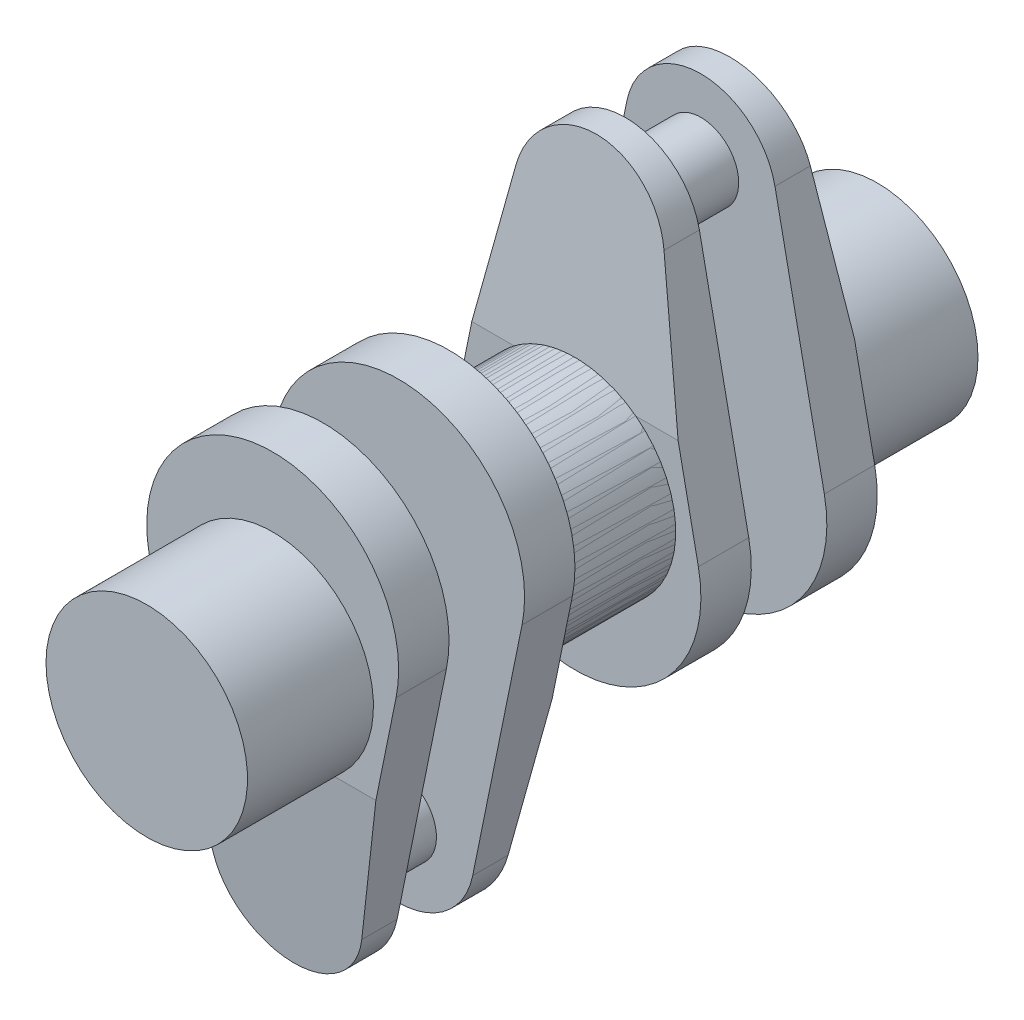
ISO-10303-21;
HEADER;
FILE_DESCRIPTION(('STEP AP214'),'2;1');
FILE_NAME('part.step','',(''),(''),'','','');
FILE_SCHEMA(('AUTOMOTIVE_DESIGN { 1 0 10303 214 1 1 1 1 }'));
ENDSEC;
DATA;
#1=APPLICATION_CONTEXT('core data for automotive mechanical design processes');
#2=APPLICATION_PROTOCOL_DEFINITION('international standard','automotive_design',2000,#1);
#3=PRODUCT_CONTEXT('',#1,'mechanical');
#4=PRODUCT('Part','Part','',(#3));
#5=PRODUCT_RELATED_PRODUCT_CATEGORY('part','',(#4));
#6=PRODUCT_DEFINITION_FORMATION('','',#4);
#7=PRODUCT_DEFINITION_CONTEXT('part definition',#1,'design');
#8=PRODUCT_DEFINITION('design','',#6,#7);
#9=PRODUCT_DEFINITION_SHAPE('','',#8);
#10=(LENGTH_UNIT() NAMED_UNIT(*) SI_UNIT(.MILLI.,.METRE.));
#11=(NAMED_UNIT(*) PLANE_ANGLE_UNIT() SI_UNIT($,.RADIAN.));
#12=(NAMED_UNIT(*) SI_UNIT($,.STERADIAN.) SOLID_ANGLE_UNIT());
#13=UNCERTAINTY_MEASURE_WITH_UNIT(LENGTH_MEASURE(1.E-05),#10,'distance_accuracy_value','');
#14=(GEOMETRIC_REPRESENTATION_CONTEXT(3) GLOBAL_UNCERTAINTY_ASSIGNED_CONTEXT((#13)) GLOBAL_UNIT_ASSIGNED_CONTEXT((#10,
#11,#12)) REPRESENTATION_CONTEXT('',''));
#15=CARTESIAN_POINT('',(0.,0.,0.));
#16=DIRECTION('',(0.,0.,1.));
#17=DIRECTION('',(1.,0.,0.));
#18=AXIS2_PLACEMENT_3D('',#15,#16,#17);
#19=CARTESIAN_POINT('',(24.8868157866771,12.7000000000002,86.3599999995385));
#20=DIRECTION('',(0.979795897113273,-0.199999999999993,0.));
#21=DIRECTION('',(0.199999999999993,0.979795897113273,0.));
#22=AXIS2_PLACEMENT_3D('',#19,#20,#21);
#23=PLANE('',#22);
#24=DIRECTION('',(0.199999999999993,0.979795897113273,0.));
#25=VECTOR('',#24,1.);
#26=CARTESIAN_POINT('',(24.8868157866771,12.7000000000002,96.5199999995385));
#27=LINE('',#26,#25);
#28=CARTESIAN_POINT('',(20.8053615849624,-7.29496040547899,96.5199999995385));
#29=VERTEX_POINT('',#28);
#30=CARTESIAN_POINT('',(24.8868157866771,12.7000000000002,96.5199999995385));
#31=VERTEX_POINT('',#30);
#32=EDGE_CURVE('E298',#29,#31,#27,.T.);
#33=ORIENTED_EDGE('',*,*,#32,.F.);
#34=DIRECTION('',(-0.198947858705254,-0.974641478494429,-0.102438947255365));
#35=VECTOR('',#34,1.);
#36=CARTESIAN_POINT('',(11.9508946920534,-50.6728120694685,91.9608040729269));
#37=LINE('',#36,#35);
#38=CARTESIAN_POINT('',(14.9320894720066,-36.0679999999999,93.4958316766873));
#39=VERTEX_POINT('',#38);
#40=EDGE_CURVE('E296',#39,#29,#37,.F.);
#41=ORIENTED_EDGE('',*,*,#40,.F.);
#42=DIRECTION('',(0.,0.,1.));
#43=VECTOR('',#42,1.);
#44=CARTESIAN_POINT('',(14.9320894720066,-36.0679999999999,86.3599999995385));
#45=LINE('',#44,#43);
#46=CARTESIAN_POINT('',(14.9320894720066,-36.0679999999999,86.3599999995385));
#47=VERTEX_POINT('',#46);
#48=EDGE_CURVE('E323',#47,#39,#45,.T.);
#49=ORIENTED_EDGE('',*,*,#48,.F.);
#50=DIRECTION('',(0.199999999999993,0.979795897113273,0.));
#51=VECTOR('',#50,1.);
#52=CARTESIAN_POINT('',(24.8868157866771,12.7000000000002,86.3599999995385));
#53=LINE('',#52,#51);
#54=CARTESIAN_POINT('',(24.8868157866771,12.7000000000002,86.3599999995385));
#55=VERTEX_POINT('',#54);
#56=EDGE_CURVE('E299',#47,#55,#53,.T.);
#57=ORIENTED_EDGE('',*,*,#56,.T.);
#58=DIRECTION('',(0.,0.,1.));
#59=VECTOR('',#58,1.);
#60=CARTESIAN_POINT('',(24.8868157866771,12.7000000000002,86.3599999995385));
#61=LINE('',#60,#59);
#62=EDGE_CURVE('E311',#55,#31,#61,.T.);
#63=ORIENTED_EDGE('',*,*,#62,.T.);
#64=EDGE_LOOP('',(#33,#41,#49,#57,#63));
#65=FACE_BOUND('',#64,.T.);
#66=ADVANCED_FACE('F184',(#65),#23,.T.);
#67=CARTESIAN_POINT('',(2.913037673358E-13,-33.02,86.3599999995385));
#68=DIRECTION('',(0.,0.,1.));
#69=DIRECTION('',(-1.,0.,0.));
#70=AXIS2_PLACEMENT_3D('',#67,#68,#69);
#71=CYLINDRICAL_SURFACE('',#70,15.24);
#72=ORIENTED_EDGE('',*,*,#48,.T.);
#73=CARTESIAN_POINT('',(2.89980637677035E-13,-33.02,93.8161893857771));
#74=DIRECTION('',(0.,0.104528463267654,-0.994521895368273));
#75=DIRECTION('',(0.,0.994521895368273,0.104528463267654));
#76=AXIS2_PLACEMENT_3D('',#73,#74,#75);
#77=ELLIPSE('',#76,15.323946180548,15.24);
#78=CARTESIAN_POINT('',(-14.9320894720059,-36.0680000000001,93.4958316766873));
#79=VERTEX_POINT('',#78);
#80=EDGE_CURVE('E277',#79,#39,#77,.F.);
#81=ORIENTED_EDGE('',*,*,#80,.F.);
#82=DIRECTION('',(0.,0.,1.));
#83=VECTOR('',#82,1.);
#84=CARTESIAN_POINT('',(-14.9320894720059,-36.0680000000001,86.3599999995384));
#85=LINE('',#84,#83);
#86=CARTESIAN_POINT('',(-14.9320894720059,-36.0680000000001,86.3599999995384));
#87=VERTEX_POINT('',#86);
#88=EDGE_CURVE('E320',#87,#79,#85,.T.);
#89=ORIENTED_EDGE('',*,*,#88,.F.);
#90=CARTESIAN_POINT('',(2.913037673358E-13,-33.02,86.3599999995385));
#91=DIRECTION('',(0.,0.,1.));
#92=DIRECTION('',(-1.,0.,0.));
#93=AXIS2_PLACEMENT_3D('',#90,#91,#92);
#94=CIRCLE('',#93,15.24);
#95=EDGE_CURVE('E302',#87,#47,#94,.T.);
#96=ORIENTED_EDGE('',*,*,#95,.T.);
#97=EDGE_LOOP('',(#72,#81,#89,#96));
#98=FACE_BOUND('',#97,.T.);
#99=ADVANCED_FACE('F415',(#98),#71,.T.);
#100=CARTESIAN_POINT('',(-24.8868157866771,12.6999999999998,86.3599999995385));
#101=DIRECTION('',(0.97979589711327,0.200000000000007,0.));
#102=DIRECTION('',(-0.200000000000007,0.97979589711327,0.));
#103=AXIS2_PLACEMENT_3D('',#100,#101,#102);
#104=PLANE('',#103);
#105=DIRECTION('',(0.198947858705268,-0.974641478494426,-0.102438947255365));
#106=VECTOR('',#105,1.);
#107=CARTESIAN_POINT('',(-11.9508946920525,-50.6728120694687,91.9608040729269));
#108=LINE('',#107,#106);
#109=CARTESIAN_POINT('',(-20.8053615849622,-7.29496040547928,96.5199999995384));
#110=VERTEX_POINT('',#109);
#111=EDGE_CURVE('E294',#79,#110,#108,.F.);
#112=ORIENTED_EDGE('',*,*,#111,.T.);
#113=DIRECTION('',(-0.200000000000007,0.97979589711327,0.));
#114=VECTOR('',#113,1.);
#115=CARTESIAN_POINT('',(-24.8868157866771,12.6999999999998,96.5199999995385));
#116=LINE('',#115,#114);
#117=CARTESIAN_POINT('',(-24.8868157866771,12.6999999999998,96.5199999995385));
#118=VERTEX_POINT('',#117);
#119=EDGE_CURVE('E274',#110,#118,#116,.T.);
#120=ORIENTED_EDGE('',*,*,#119,.T.);
#121=DIRECTION('',(0.,0.,1.));
#122=VECTOR('',#121,1.);
#123=CARTESIAN_POINT('',(-24.8868157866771,12.6999999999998,86.3599999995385));
#124=LINE('',#123,#122);
#125=CARTESIAN_POINT('',(-24.8868157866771,12.6999999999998,86.3599999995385));
#126=VERTEX_POINT('',#125);
#127=EDGE_CURVE('E317',#126,#118,#124,.T.);
#128=ORIENTED_EDGE('',*,*,#127,.F.);
#129=DIRECTION('',(-0.200000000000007,0.97979589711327,0.));
#130=VECTOR('',#129,1.);
#131=CARTESIAN_POINT('',(-24.8868157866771,12.6999999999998,86.3599999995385));
#132=LINE('',#131,#130);
#133=EDGE_CURVE('E306',#87,#126,#132,.T.);
#134=ORIENTED_EDGE('',*,*,#133,.F.);
#135=ORIENTED_EDGE('',*,*,#88,.T.);
#136=EDGE_LOOP('',(#112,#120,#128,#134,#135));
#137=FACE_BOUND('',#136,.T.);
#138=ADVANCED_FACE('F421',(#137),#104,.F.);
#139=CARTESIAN_POINT('',(0.,17.78,96.5199999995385));
#140=DIRECTION('',(0.,0.,-1.));
#141=DIRECTION('',(-1.,0.,0.));
#142=AXIS2_PLACEMENT_3D('',#139,#140,#141);
#143=PLANE('',#142);
#144=CARTESIAN_POINT('',(0.,8.88999999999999,96.5199999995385));
#145=DIRECTION('',(0.,0.,1.));
#146=DIRECTION('',(-1.,0.,0.));
#147=AXIS2_PLACEMENT_3D('',#144,#145,#146);
#148=CIRCLE('',#147,20.32);
#149=CARTESIAN_POINT('',(12.2861489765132,-7.29496040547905,96.5199999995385));
#150=VERTEX_POINT('',#149);
#151=CARTESIAN_POINT('',(-12.286148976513,-7.29496040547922,96.5199999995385));
#152=VERTEX_POINT('',#151);
#153=EDGE_CURVE('E13',#150,#152,#148,.T.);
#154=ORIENTED_EDGE('',*,*,#153,.F.);
#155=DIRECTION('',(-1.,0.,0.));
#156=VECTOR('',#155,1.);
#157=CARTESIAN_POINT('',(1.09863844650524E-13,-7.29496040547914,96.5199999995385));
#158=LINE('',#157,#156);
#159=EDGE_CURVE('E204',#150,#29,#158,.F.);
#160=ORIENTED_EDGE('',*,*,#159,.T.);
#161=ORIENTED_EDGE('',*,*,#32,.T.);
#162=CARTESIAN_POINT('',(0.,17.78,96.5199999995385));
#163=DIRECTION('',(0.,0.,1.));
#164=DIRECTION('',(-1.,0.,0.));
#165=AXIS2_PLACEMENT_3D('',#162,#163,#164);
#166=CIRCLE('',#165,25.4);
#167=EDGE_CURVE('E303',#31,#118,#166,.T.);
#168=ORIENTED_EDGE('',*,*,#167,.T.);
#169=ORIENTED_EDGE('',*,*,#119,.F.);
#170=EDGE_CURVE('E270',#110,#152,#158,.F.);
#171=ORIENTED_EDGE('',*,*,#170,.T.);
#172=EDGE_LOOP('',(#154,#160,#161,#168,#169,#171));
#173=FACE_BOUND('',#172,.T.);
#174=ADVANCED_FACE('F272',(#173),#143,.F.);
#175=CARTESIAN_POINT('',(0.,17.78,60.9599999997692));
#176=DIRECTION('',(0.,0.,1.));
#177=DIRECTION('',(-1.,0.,0.));
#178=AXIS2_PLACEMENT_3D('',#175,#176,#177);
#179=PLANE('',#178);
#180=DIRECTION('',(1.,0.,0.));
#181=VECTOR('',#180,1.);
#182=CARTESIAN_POINT('',(1.13018974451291E-13,-7.29496040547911,60.9599999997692));
#183=LINE('',#182,#181);
#184=CARTESIAN_POINT('',(12.2861489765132,-7.29496040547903,60.9599999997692));
#185=VERTEX_POINT('',#184);
#186=CARTESIAN_POINT('',(20.8053615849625,-7.29496040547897,60.9599999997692));
#187=VERTEX_POINT('',#186);
#188=EDGE_CURVE('E330',#185,#187,#183,.T.);
#189=ORIENTED_EDGE('',*,*,#188,.F.);
#190=CARTESIAN_POINT('',(0.,8.89,60.9599999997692));
#191=DIRECTION('',(0.,0.,1.));
#192=DIRECTION('',(-1.,0.,0.));
#193=AXIS2_PLACEMENT_3D('',#190,#191,#192);
#194=CIRCLE('',#193,20.32);
#195=CARTESIAN_POINT('',(-12.286148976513,-7.2949604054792,60.9599999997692));
#196=VERTEX_POINT('',#195);
#197=EDGE_CURVE('E193',#185,#196,#194,.T.);
#198=ORIENTED_EDGE('',*,*,#197,.T.);
#199=CARTESIAN_POINT('',(-20.8053615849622,-7.29496040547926,60.9599999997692));
#200=VERTEX_POINT('',#199);
#201=EDGE_CURVE('E334',#200,#196,#183,.T.);
#202=ORIENTED_EDGE('',*,*,#201,.F.);
#203=DIRECTION('',(-0.200000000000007,0.97979589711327,0.));
#204=VECTOR('',#203,1.);
#205=CARTESIAN_POINT('',(-24.8868157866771,12.6999999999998,60.9599999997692));
#206=LINE('',#205,#204);
#207=CARTESIAN_POINT('',(-24.8868157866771,12.6999999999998,60.9599999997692));
#208=VERTEX_POINT('',#207);
#209=EDGE_CURVE('E355',#200,#208,#206,.T.);
#210=ORIENTED_EDGE('',*,*,#209,.T.);
#211=CARTESIAN_POINT('',(0.,17.78,60.9599999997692));
#212=DIRECTION('',(0.,0.,1.));
#213=DIRECTION('',(-1.,0.,0.));
#214=AXIS2_PLACEMENT_3D('',#211,#212,#213);
#215=CIRCLE('',#214,25.4);
#216=CARTESIAN_POINT('',(24.8868157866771,12.7000000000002,60.9599999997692));
#217=VERTEX_POINT('',#216);
#218=EDGE_CURVE('E364',#217,#208,#215,.T.);
#219=ORIENTED_EDGE('',*,*,#218,.F.);
#220=DIRECTION('',(0.199999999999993,0.979795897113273,0.));
#221=VECTOR('',#220,1.);
#222=CARTESIAN_POINT('',(24.8868157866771,12.7000000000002,60.9599999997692));
#223=LINE('',#222,#221);
#224=EDGE_CURVE('E350',#187,#217,#223,.T.);
#225=ORIENTED_EDGE('',*,*,#224,.F.);
#226=EDGE_LOOP('',(#189,#198,#202,#210,#219,#225));
#227=FACE_BOUND('',#226,.T.);
#228=ADVANCED_FACE('F384',(#227),#179,.F.);
#229=CARTESIAN_POINT('',(0.,17.78,71.1199999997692));
#230=DIRECTION('',(0.,0.,-1.));
#231=DIRECTION('',(1.,0.,0.));
#232=AXIS2_PLACEMENT_3D('',#229,#230,#231);
#233=CYLINDRICAL_SURFACE('',#232,25.4);
#234=ORIENTED_EDGE('',*,*,#218,.T.);
#235=DIRECTION('',(0.,0.,-1.));
#236=VECTOR('',#235,1.);
#237=CARTESIAN_POINT('',(-24.8868157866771,12.6999999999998,71.1199999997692));
#238=LINE('',#237,#236);
#239=CARTESIAN_POINT('',(-24.8868157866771,12.6999999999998,71.1199999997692));
#240=VERTEX_POINT('',#239);
#241=EDGE_CURVE('E372',#240,#208,#238,.T.);
#242=ORIENTED_EDGE('',*,*,#241,.F.);
#243=CARTESIAN_POINT('',(0.,17.78,71.1199999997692));
#244=DIRECTION('',(0.,0.,1.));
#245=DIRECTION('',(-1.,0.,0.));
#246=AXIS2_PLACEMENT_3D('',#243,#244,#245);
#247=CIRCLE('',#246,25.4);
#248=CARTESIAN_POINT('',(24.8868157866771,12.7000000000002,71.1199999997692));
#249=VERTEX_POINT('',#248);
#250=EDGE_CURVE('E354',#249,#240,#247,.T.);
#251=ORIENTED_EDGE('',*,*,#250,.F.);
#252=DIRECTION('',(0.,0.,-1.));
#253=VECTOR('',#252,1.);
#254=CARTESIAN_POINT('',(24.8868157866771,12.7000000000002,71.1199999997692));
#255=LINE('',#254,#253);
#256=EDGE_CURVE('E188',#249,#217,#255,.T.);
#257=ORIENTED_EDGE('',*,*,#256,.T.);
#258=EDGE_LOOP('',(#234,#242,#251,#257));
#259=FACE_BOUND('',#258,.T.);
#260=ADVANCED_FACE('F401',(#259),#233,.T.);
#261=CARTESIAN_POINT('',(-24.8868157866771,12.6999999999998,71.1199999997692));
#262=DIRECTION('',(-0.97979589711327,-0.200000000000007,0.));
#263=DIRECTION('',(0.200000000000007,-0.97979589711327,0.));
#264=AXIS2_PLACEMENT_3D('',#261,#262,#263);
#265=PLANE('',#264);
#266=DIRECTION('',(0.198947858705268,-0.974641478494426,0.102438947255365));
#267=VECTOR('',#266,1.);
#268=CARTESIAN_POINT('',(-11.9508946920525,-50.6728120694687,65.5191959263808));
#269=LINE('',#268,#267);
#270=CARTESIAN_POINT('',(-14.9320894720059,-36.0680000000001,63.9841683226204));
#271=VERTEX_POINT('',#270);
#272=EDGE_CURVE('E342',#200,#271,#269,.T.);
#273=ORIENTED_EDGE('',*,*,#272,.T.);
#274=DIRECTION('',(0.,0.,-1.));
#275=VECTOR('',#274,1.);
#276=CARTESIAN_POINT('',(-14.9320894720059,-36.0680000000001,71.1199999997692));
#277=LINE('',#276,#275);
#278=CARTESIAN_POINT('',(-14.9320894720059,-36.0680000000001,71.1199999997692));
#279=VERTEX_POINT('',#278);
#280=EDGE_CURVE('E370',#279,#271,#277,.T.);
#281=ORIENTED_EDGE('',*,*,#280,.F.);
#282=DIRECTION('',(-0.200000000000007,0.97979589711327,0.));
#283=VECTOR('',#282,1.);
#284=CARTESIAN_POINT('',(-24.8868157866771,12.6999999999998,71.1199999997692));
#285=LINE('',#284,#283);
#286=EDGE_CURVE('E357',#279,#240,#285,.T.);
#287=ORIENTED_EDGE('',*,*,#286,.T.);
#288=ORIENTED_EDGE('',*,*,#241,.T.);
#289=ORIENTED_EDGE('',*,*,#209,.F.);
#290=EDGE_LOOP('',(#273,#281,#287,#288,#289));
#291=FACE_BOUND('',#290,.T.);
#292=ADVANCED_FACE('F392',(#291),#265,.T.);
#293=CARTESIAN_POINT('',(2.92655965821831E-13,-33.02,71.1199999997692));
#294=DIRECTION('',(0.,0.,-1.));
#295=DIRECTION('',(1.,0.,0.));
#296=AXIS2_PLACEMENT_3D('',#293,#294,#295);
#297=CYLINDRICAL_SURFACE('',#296,15.24);
#298=ORIENTED_EDGE('',*,*,#280,.T.);
#299=CARTESIAN_POINT('',(2.92655965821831E-13,-33.02,63.6638106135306));
#300=DIRECTION('',(0.,0.104528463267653,0.994521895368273));
#301=DIRECTION('',(0.,0.994521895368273,-0.104528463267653));
#302=AXIS2_PLACEMENT_3D('',#299,#300,#301);
#303=ELLIPSE('',#302,15.323946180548,15.24);
#304=CARTESIAN_POINT('',(14.9320894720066,-36.0679999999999,63.9841683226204));
#305=VERTEX_POINT('',#304);
#306=EDGE_CURVE('E337',#305,#271,#303,.F.);
#307=ORIENTED_EDGE('',*,*,#306,.F.);
#308=DIRECTION('',(0.,0.,-1.));
#309=VECTOR('',#308,1.);
#310=CARTESIAN_POINT('',(14.9320894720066,-36.0679999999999,71.1199999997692));
#311=LINE('',#310,#309);
#312=CARTESIAN_POINT('',(14.9320894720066,-36.0679999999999,71.1199999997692));
#313=VERTEX_POINT('',#312);
#314=EDGE_CURVE('E362',#313,#305,#311,.T.);
#315=ORIENTED_EDGE('',*,*,#314,.F.);
#316=CARTESIAN_POINT('',(2.92655965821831E-13,-33.02,71.1199999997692));
#317=DIRECTION('',(0.,0.,1.));
#318=DIRECTION('',(-1.,0.,0.));
#319=AXIS2_PLACEMENT_3D('',#316,#317,#318);
#320=CIRCLE('',#319,15.24);
#321=EDGE_CURVE('E360',#279,#313,#320,.T.);
#322=ORIENTED_EDGE('',*,*,#321,.F.);
#323=EDGE_LOOP('',(#298,#307,#315,#322));
#324=FACE_BOUND('',#323,.T.);
#325=ADVANCED_FACE('F395',(#324),#297,.T.);
#326=CARTESIAN_POINT('',(24.8868157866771,12.7000000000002,71.1199999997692));
#327=DIRECTION('',(-0.979795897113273,0.199999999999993,0.));
#328=DIRECTION('',(-0.199999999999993,-0.979795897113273,0.));
#329=AXIS2_PLACEMENT_3D('',#326,#327,#328);
#330=PLANE('',#329);
#331=ORIENTED_EDGE('',*,*,#314,.T.);
#332=DIRECTION('',(-0.198947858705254,-0.974641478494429,0.102438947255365));
#333=VECTOR('',#332,1.);
#334=CARTESIAN_POINT('',(11.9508946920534,-50.6728120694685,65.5191959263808));
#335=LINE('',#334,#333);
#336=EDGE_CURVE('E340',#187,#305,#335,.T.);
#337=ORIENTED_EDGE('',*,*,#336,.F.);
#338=ORIENTED_EDGE('',*,*,#224,.T.);
#339=ORIENTED_EDGE('',*,*,#256,.F.);
#340=DIRECTION('',(0.199999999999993,0.979795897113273,0.));
#341=VECTOR('',#340,1.);
#342=CARTESIAN_POINT('',(24.8868157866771,12.7000000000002,71.1199999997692));
#343=LINE('',#342,#341);
#344=EDGE_CURVE('E351',#313,#249,#343,.T.);
#345=ORIENTED_EDGE('',*,*,#344,.F.);
#346=EDGE_LOOP('',(#331,#337,#338,#339,#345));
#347=FACE_BOUND('',#346,.T.);
#348=ADVANCED_FACE('F186',(#347),#330,.F.);
#349=CARTESIAN_POINT('',(0.,17.78,71.1199999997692));
#350=DIRECTION('',(0.,0.,1.));
#351=DIRECTION('',(-1.,0.,0.));
#352=AXIS2_PLACEMENT_3D('',#349,#350,#351);
#353=PLANE('',#352);
#354=CARTESIAN_POINT('',(2.92655965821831E-13,-33.02,71.1199999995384));
#355=DIRECTION('',(0.,0.,1.));
#356=DIRECTION('',(0.,1.,0.));
#357=AXIS2_PLACEMENT_3D('',#354,#355,#356);
#358=CIRCLE('',#357,7.62);
#359=CARTESIAN_POINT('',(2.39445790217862E-13,-25.4,71.1199999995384));
#360=VERTEX_POINT('',#359);
#361=EDGE_CURVE('E345',#360,#360,#358,.T.);
#362=ORIENTED_EDGE('',*,*,#361,.F.);
#363=EDGE_LOOP('',(#362));
#364=FACE_BOUND('',#363,.T.);
#365=ORIENTED_EDGE('',*,*,#344,.T.);
#366=ORIENTED_EDGE('',*,*,#250,.T.);
#367=ORIENTED_EDGE('',*,*,#286,.F.);
#368=ORIENTED_EDGE('',*,*,#321,.T.);
#369=EDGE_LOOP('',(#365,#366,#367,#368));
#370=FACE_BOUND('',#369,.T.);
#371=ADVANCED_FACE('F400',(#364,#370),#353,.T.);
#372=CARTESIAN_POINT('',(2.92655965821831E-13,-33.02,107.912614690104));
#373=DIRECTION('',(0.,0.,-1.));
#374=DIRECTION('',(1.,0.,0.));
#375=AXIS2_PLACEMENT_3D('',#372,#373,#374);
#376=CYLINDRICAL_SURFACE('',#375,7.62);
#377=ORIENTED_EDGE('',*,*,#361,.T.);
#378=EDGE_LOOP('',(#377));
#379=FACE_BOUND('',#378,.T.);
#380=CARTESIAN_POINT('',(2.92655965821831E-13,-33.02,86.3599999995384));
#381=DIRECTION('',(0.,0.,-1.));
#382=DIRECTION('',(0.,-1.,0.));
#383=AXIS2_PLACEMENT_3D('',#380,#381,#382);
#384=CIRCLE('',#383,7.62);
#385=CARTESIAN_POINT('',(3.45866141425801E-13,-40.64,86.3599999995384));
#386=VERTEX_POINT('',#385);
#387=EDGE_CURVE('E326',#386,#386,#384,.T.);
#388=ORIENTED_EDGE('',*,*,#387,.T.);
#389=EDGE_LOOP('',(#388));
#390=FACE_BOUND('',#389,.T.);
#391=ADVANCED_FACE('F410',(#379,#390),#376,.T.);
#392=CARTESIAN_POINT('',(3.9907631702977E-13,-48.26,65.2655991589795));
#393=DIRECTION('',(0.,0.104528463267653,0.994521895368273));
#394=DIRECTION('',(0.,0.994521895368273,-0.104528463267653));
#395=AXIS2_PLACEMENT_3D('',#392,#393,#394);
#396=PLANE('',#395);
#397=ORIENTED_EDGE('',*,*,#272,.F.);
#398=ORIENTED_EDGE('',*,*,#201,.T.);
#399=EDGE_CURVE('E338',#196,#185,#183,.T.);
#400=ORIENTED_EDGE('',*,*,#399,.T.);
#401=ORIENTED_EDGE('',*,*,#188,.T.);
#402=ORIENTED_EDGE('',*,*,#336,.T.);
#403=ORIENTED_EDGE('',*,*,#306,.T.);
#404=EDGE_LOOP('',(#397,#398,#400,#401,#402,#403));
#405=FACE_BOUND('',#404,.T.);
#406=ADVANCED_FACE('F389',(#405),#396,.F.);
#407=CARTESIAN_POINT('',(0.,17.78,60.9599999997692));
#408=DIRECTION('',(0.,0.,1.));
#409=DIRECTION('',(-1.,0.,0.));
#410=AXIS2_PLACEMENT_3D('',#407,#408,#409);
#411=PLANE('',#410);
#412=ORIENTED_EDGE('',*,*,#399,.F.);
#413=EDGE_CURVE('E331',#196,#185,#194,.T.);
#414=ORIENTED_EDGE('',*,*,#413,.T.);
#415=EDGE_LOOP('',(#412,#414));
#416=FACE_BOUND('',#415,.T.);
#417=ADVANCED_FACE('F433',(#416),#411,.T.);
#418=CARTESIAN_POINT('',(0.,8.89,35.5599999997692));
#419=DIRECTION('',(0.,0.,1.));
#420=DIRECTION('',(-1.,0.,0.));
#421=AXIS2_PLACEMENT_3D('',#418,#419,#420);
#422=CYLINDRICAL_SURFACE('',#421,20.32);
#423=ORIENTED_EDGE('',*,*,#413,.F.);
#424=ORIENTED_EDGE('',*,*,#197,.F.);
#425=EDGE_LOOP('',(#423,#424));
#426=FACE_BOUND('',#425,.T.);
#427=CARTESIAN_POINT('',(0.,8.89,35.5599999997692));
#428=DIRECTION('',(0.,0.,1.));
#429=DIRECTION('',(-1.,0.,0.));
#430=AXIS2_PLACEMENT_3D('',#427,#428,#429);
#431=CIRCLE('',#430,20.32);
#432=CARTESIAN_POINT('',(-20.32,8.88999999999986,35.5599999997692));
#433=VERTEX_POINT('',#432);
#434=EDGE_CURVE('E327',#433,#433,#431,.T.);
#435=ORIENTED_EDGE('',*,*,#434,.T.);
#436=EDGE_LOOP('',(#435));
#437=FACE_BOUND('',#436,.T.);
#438=ADVANCED_FACE('F431',(#426,#437),#422,.T.);
#439=CARTESIAN_POINT('',(0.,17.78,35.5599999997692));
#440=DIRECTION('',(0.,0.,1.));
#441=DIRECTION('',(-1.,0.,0.));
#442=AXIS2_PLACEMENT_3D('',#439,#440,#441);
#443=PLANE('',#442);
#444=ORIENTED_EDGE('',*,*,#434,.F.);
#445=EDGE_LOOP('',(#444));
#446=FACE_BOUND('',#445,.T.);
#447=ADVANCED_FACE('F427',(#446),#443,.F.);
#448=CARTESIAN_POINT('',(0.,17.78,86.3599999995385));
#449=DIRECTION('',(0.,0.,1.));
#450=DIRECTION('',(-1.,0.,0.));
#451=AXIS2_PLACEMENT_3D('',#448,#449,#450);
#452=CYLINDRICAL_SURFACE('',#451,25.4);
#453=ORIENTED_EDGE('',*,*,#167,.F.);
#454=ORIENTED_EDGE('',*,*,#62,.F.);
#455=CARTESIAN_POINT('',(0.,17.78,86.3599999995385));
#456=DIRECTION('',(0.,0.,1.));
#457=DIRECTION('',(-1.,0.,0.));
#458=AXIS2_PLACEMENT_3D('',#455,#456,#457);
#459=CIRCLE('',#458,25.4);
#460=EDGE_CURVE('E308',#55,#126,#459,.T.);
#461=ORIENTED_EDGE('',*,*,#460,.T.);
#462=ORIENTED_EDGE('',*,*,#127,.T.);
#463=EDGE_LOOP('',(#453,#454,#461,#462));
#464=FACE_BOUND('',#463,.T.);
#465=ADVANCED_FACE('F430',(#464),#452,.T.);
#466=CARTESIAN_POINT('',(0.,17.78,86.3599999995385));
#467=DIRECTION('',(0.,0.,-1.));
#468=DIRECTION('',(-1.,0.,0.));
#469=AXIS2_PLACEMENT_3D('',#466,#467,#468);
#470=PLANE('',#469);
#471=ORIENTED_EDGE('',*,*,#387,.F.);
#472=EDGE_LOOP('',(#471));
#473=FACE_BOUND('',#472,.T.);
#474=ORIENTED_EDGE('',*,*,#56,.F.);
#475=ORIENTED_EDGE('',*,*,#95,.F.);
#476=ORIENTED_EDGE('',*,*,#133,.T.);
#477=ORIENTED_EDGE('',*,*,#460,.F.);
#478=EDGE_LOOP('',(#474,#475,#476,#477));
#479=FACE_BOUND('',#478,.T.);
#480=ADVANCED_FACE('F521',(#473,#479),#470,.T.);
#481=CARTESIAN_POINT('',(3.96685232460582E-13,-48.26,92.2144008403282));
#482=DIRECTION('',(0.,0.104528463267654,-0.994521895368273));
#483=DIRECTION('',(0.,-0.994521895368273,-0.104528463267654));
#484=AXIS2_PLACEMENT_3D('',#481,#482,#483);
#485=PLANE('',#484);
#486=ORIENTED_EDGE('',*,*,#80,.T.);
#487=ORIENTED_EDGE('',*,*,#40,.T.);
#488=ORIENTED_EDGE('',*,*,#159,.F.);
#489=EDGE_CURVE('E278',#152,#150,#158,.F.);
#490=ORIENTED_EDGE('',*,*,#489,.F.);
#491=ORIENTED_EDGE('',*,*,#170,.F.);
#492=ORIENTED_EDGE('',*,*,#111,.F.);
#493=EDGE_LOOP('',(#486,#487,#488,#490,#491,#492));
#494=FACE_BOUND('',#493,.T.);
#495=ADVANCED_FACE('F281',(#494),#485,.F.);
#496=CARTESIAN_POINT('',(0.,8.88999999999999,121.919999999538));
#497=DIRECTION('',(0.,0.,-1.));
#498=DIRECTION('',(1.,0.,0.));
#499=AXIS2_PLACEMENT_3D('',#496,#497,#498);
#500=CYLINDRICAL_SURFACE('',#499,20.32);
#501=EDGE_CURVE('E195',#152,#150,#148,.T.);
#502=ORIENTED_EDGE('',*,*,#501,.T.);
#503=ORIENTED_EDGE('',*,*,#153,.T.);
#504=EDGE_LOOP('',(#502,#503));
#505=FACE_BOUND('',#504,.T.);
#506=CARTESIAN_POINT('',(0.,8.88999999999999,121.919999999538));
#507=DIRECTION('',(0.,0.,1.));
#508=DIRECTION('',(-1.,0.,0.));
#509=AXIS2_PLACEMENT_3D('',#506,#507,#508);
#510=CIRCLE('',#509,20.32);
#511=CARTESIAN_POINT('',(-20.32,8.88999999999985,121.919999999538));
#512=VERTEX_POINT('',#511);
#513=EDGE_CURVE('E289',#512,#512,#510,.T.);
#514=ORIENTED_EDGE('',*,*,#513,.F.);
#515=EDGE_LOOP('',(#514));
#516=FACE_BOUND('',#515,.T.);
#517=ADVANCED_FACE('F286',(#505,#516),#500,.T.);
#518=CARTESIAN_POINT('',(0.,17.78,121.919999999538));
#519=DIRECTION('',(0.,0.,-1.));
#520=DIRECTION('',(-1.,0.,0.));
#521=AXIS2_PLACEMENT_3D('',#518,#519,#520);
#522=PLANE('',#521);
#523=ORIENTED_EDGE('',*,*,#513,.T.);
#524=EDGE_LOOP('',(#523));
#525=FACE_BOUND('',#524,.T.);
#526=ADVANCED_FACE('F552',(#525),#522,.F.);
#527=CARTESIAN_POINT('',(0.,17.78,96.5199999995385));
#528=DIRECTION('',(0.,0.,-1.));
#529=DIRECTION('',(-1.,0.,0.));
#530=AXIS2_PLACEMENT_3D('',#527,#528,#529);
#531=PLANE('',#530);
#532=ORIENTED_EDGE('',*,*,#501,.F.);
#533=ORIENTED_EDGE('',*,*,#489,.T.);
#534=EDGE_LOOP('',(#532,#533));
#535=FACE_BOUND('',#534,.T.);
#536=ADVANCED_FACE('F288',(#535),#531,.T.);
#537=CLOSED_SHELL('',(#66,#99,#138,#174,#228,#260,#292,#325,#348,#371,#391,#406,#417,#438,#447,
#465,#480,#495,#517,#526,#536));
#538=MANIFOLD_SOLID_BREP('B2',#537);
#539=CARTESIAN_POINT('',(-24.8868157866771,5.08,25.3999999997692));
#540=DIRECTION('',(-0.979795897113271,0.2,0.));
#541=DIRECTION('',(-0.2,-0.979795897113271,0.));
#542=AXIS2_PLACEMENT_3D('',#539,#540,#541);
#543=PLANE('',#542);
#544=DIRECTION('',(-0.2,-0.979795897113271,0.));
#545=VECTOR('',#544,1.);
#546=CARTESIAN_POINT('',(-24.8868157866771,5.08,35.5599999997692));
#547=LINE('',#546,#545);
#548=CARTESIAN_POINT('',(-20.8053615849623,25.0749604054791,35.5599999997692));
#549=VERTEX_POINT('',#548);
#550=CARTESIAN_POINT('',(-24.8868157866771,5.08,35.5599999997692));
#551=VERTEX_POINT('',#550);
#552=EDGE_CURVE('E852',#549,#551,#547,.T.);
#553=ORIENTED_EDGE('',*,*,#552,.F.);
#554=DIRECTION('',(0.198947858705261,0.974641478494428,-0.102438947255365));
#555=VECTOR('',#554,1.);
#556=CARTESIAN_POINT('',(-11.950894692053,68.4528120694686,31.0008040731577));
#557=LINE('',#556,#555);
#558=CARTESIAN_POINT('',(-14.9320894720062,53.848,32.5358316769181));
#559=VERTEX_POINT('',#558);
#560=EDGE_CURVE('E850',#559,#549,#557,.F.);
#561=ORIENTED_EDGE('',*,*,#560,.F.);
#562=DIRECTION('',(0.,0.,1.));
#563=VECTOR('',#562,1.);
#564=CARTESIAN_POINT('',(-14.9320894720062,53.848,25.3999999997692));
#565=LINE('',#564,#563);
#566=CARTESIAN_POINT('',(-14.9320894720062,53.848,25.3999999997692));
#567=VERTEX_POINT('',#566);
#568=EDGE_CURVE('E877',#567,#559,#565,.T.);
#569=ORIENTED_EDGE('',*,*,#568,.F.);
#570=DIRECTION('',(-0.2,-0.979795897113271,0.));
#571=VECTOR('',#570,1.);
#572=CARTESIAN_POINT('',(-24.8868157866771,5.08,25.3999999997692));
#573=LINE('',#572,#571);
#574=CARTESIAN_POINT('',(-24.8868157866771,5.08,25.3999999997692));
#575=VERTEX_POINT('',#574);
#576=EDGE_CURVE('E853',#567,#575,#573,.T.);
#577=ORIENTED_EDGE('',*,*,#576,.T.);
#578=DIRECTION('',(0.,0.,1.));
#579=VECTOR('',#578,1.);
#580=CARTESIAN_POINT('',(-24.8868157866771,5.08,25.3999999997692));
#581=LINE('',#580,#579);
#582=EDGE_CURVE('E865',#575,#551,#581,.T.);
#583=ORIENTED_EDGE('',*,*,#582,.T.);
#584=EDGE_LOOP('',(#553,#561,#569,#577,#583));
#585=FACE_BOUND('',#584,.T.);
#586=ADVANCED_FACE('F738',(#585),#543,.T.);
#587=CARTESIAN_POINT('',(0.,50.8,25.3999999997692));
#588=DIRECTION('',(0.,0.,1.));
#589=DIRECTION('',(1.,0.,0.));
#590=AXIS2_PLACEMENT_3D('',#587,#588,#589);
#591=CYLINDRICAL_SURFACE('',#590,15.24);
#592=ORIENTED_EDGE('',*,*,#568,.T.);
#593=CARTESIAN_POINT('',(0.,50.8,32.8561893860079));
#594=DIRECTION('',(0.,-0.104528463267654,-0.994521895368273));
#595=DIRECTION('',(0.,-0.994521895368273,0.104528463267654));
#596=AXIS2_PLACEMENT_3D('',#593,#594,#595);
#597=ELLIPSE('',#596,15.323946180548,15.24);
#598=CARTESIAN_POINT('',(14.9320894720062,53.848,32.5358316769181));
#599=VERTEX_POINT('',#598);
#600=EDGE_CURVE('E831',#599,#559,#597,.F.);
#601=ORIENTED_EDGE('',*,*,#600,.F.);
#602=DIRECTION('',(0.,0.,1.));
#603=VECTOR('',#602,1.);
#604=CARTESIAN_POINT('',(14.9320894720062,53.848,25.3999999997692));
#605=LINE('',#604,#603);
#606=CARTESIAN_POINT('',(14.9320894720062,53.848,25.3999999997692));
#607=VERTEX_POINT('',#606);
#608=EDGE_CURVE('E874',#607,#599,#605,.T.);
#609=ORIENTED_EDGE('',*,*,#608,.F.);
#610=CARTESIAN_POINT('',(0.,50.8,25.3999999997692));
#611=DIRECTION('',(0.,0.,1.));
#612=DIRECTION('',(1.,0.,0.));
#613=AXIS2_PLACEMENT_3D('',#610,#611,#612);
#614=CIRCLE('',#613,15.24);
#615=EDGE_CURVE('E856',#607,#567,#614,.T.);
#616=ORIENTED_EDGE('',*,*,#615,.T.);
#617=EDGE_LOOP('',(#592,#601,#609,#616));
#618=FACE_BOUND('',#617,.T.);
#619=ADVANCED_FACE('F969',(#618),#591,.T.);
#620=CARTESIAN_POINT('',(24.8868157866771,5.08,25.3999999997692));
#621=DIRECTION('',(-0.979795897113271,-0.2,0.));
#622=DIRECTION('',(0.2,-0.979795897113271,0.));
#623=AXIS2_PLACEMENT_3D('',#620,#621,#622);
#624=PLANE('',#623);
#625=DIRECTION('',(-0.198947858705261,0.974641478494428,-0.102438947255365));
#626=VECTOR('',#625,1.);
#627=CARTESIAN_POINT('',(11.950894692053,68.4528120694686,31.0008040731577));
#628=LINE('',#627,#626);
#629=CARTESIAN_POINT('',(20.8053615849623,25.0749604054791,35.5599999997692));
#630=VERTEX_POINT('',#629);
#631=EDGE_CURVE('E848',#599,#630,#628,.F.);
#632=ORIENTED_EDGE('',*,*,#631,.T.);
#633=DIRECTION('',(0.2,-0.979795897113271,0.));
#634=VECTOR('',#633,1.);
#635=CARTESIAN_POINT('',(24.8868157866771,5.08,35.5599999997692));
#636=LINE('',#635,#634);
#637=CARTESIAN_POINT('',(24.8868157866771,5.08,35.5599999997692));
#638=VERTEX_POINT('',#637);
#639=EDGE_CURVE('E828',#630,#638,#636,.T.);
#640=ORIENTED_EDGE('',*,*,#639,.T.);
#641=DIRECTION('',(0.,0.,1.));
#642=VECTOR('',#641,1.);
#643=CARTESIAN_POINT('',(24.8868157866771,5.08,25.3999999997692));
#644=LINE('',#643,#642);
#645=CARTESIAN_POINT('',(24.8868157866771,5.08,25.3999999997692));
#646=VERTEX_POINT('',#645);
#647=EDGE_CURVE('E871',#646,#638,#644,.T.);
#648=ORIENTED_EDGE('',*,*,#647,.F.);
#649=DIRECTION('',(0.2,-0.979795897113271,0.));
#650=VECTOR('',#649,1.);
#651=CARTESIAN_POINT('',(24.8868157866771,5.08,25.3999999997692));
#652=LINE('',#651,#650);
#653=EDGE_CURVE('E860',#607,#646,#652,.T.);
#654=ORIENTED_EDGE('',*,*,#653,.F.);
#655=ORIENTED_EDGE('',*,*,#608,.T.);
#656=EDGE_LOOP('',(#632,#640,#648,#654,#655));
#657=FACE_BOUND('',#656,.T.);
#658=ADVANCED_FACE('F975',(#657),#624,.F.);
#659=CARTESIAN_POINT('',(0.,0.,35.5599999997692));
#660=DIRECTION('',(0.,0.,-1.));
#661=DIRECTION('',(1.,0.,0.));
#662=AXIS2_PLACEMENT_3D('',#659,#660,#661);
#663=PLANE('',#662);
#664=CARTESIAN_POINT('',(0.,8.89,35.5599999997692));
#665=DIRECTION('',(0.,0.,1.));
#666=DIRECTION('',(1.,0.,0.));
#667=AXIS2_PLACEMENT_3D('',#664,#665,#666);
#668=CIRCLE('',#667,20.32);
#669=CARTESIAN_POINT('',(-12.2861489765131,25.0749604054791,35.5599999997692));
#670=VERTEX_POINT('',#669);
#671=CARTESIAN_POINT('',(12.2861489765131,25.0749604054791,35.5599999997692));
#672=VERTEX_POINT('',#671);
#673=EDGE_CURVE('E182',#670,#672,#668,.T.);
#674=ORIENTED_EDGE('',*,*,#673,.F.);
#675=DIRECTION('',(1.,0.,0.));
#676=VECTOR('',#675,1.);
#677=CARTESIAN_POINT('',(0.,25.0749604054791,35.5599999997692));
#678=LINE('',#677,#676);
#679=EDGE_CURVE('E758',#670,#549,#678,.F.);
#680=ORIENTED_EDGE('',*,*,#679,.T.);
#681=ORIENTED_EDGE('',*,*,#552,.T.);
#682=CARTESIAN_POINT('',(0.,0.,35.5599999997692));
#683=DIRECTION('',(0.,0.,1.));
#684=DIRECTION('',(1.,0.,0.));
#685=AXIS2_PLACEMENT_3D('',#682,#683,#684);
#686=CIRCLE('',#685,25.4);
#687=EDGE_CURVE('E857',#551,#638,#686,.T.);
#688=ORIENTED_EDGE('',*,*,#687,.T.);
#689=ORIENTED_EDGE('',*,*,#639,.F.);
#690=EDGE_CURVE('E824',#630,#672,#678,.F.);
#691=ORIENTED_EDGE('',*,*,#690,.T.);
#692=EDGE_LOOP('',(#674,#680,#681,#688,#689,#691));
#693=FACE_BOUND('',#692,.T.);
#694=ADVANCED_FACE('F826',(#693),#663,.F.);
#695=CARTESIAN_POINT('',(0.,0.,0.));
#696=DIRECTION('',(0.,0.,1.));
#697=DIRECTION('',(1.,0.,0.));
#698=AXIS2_PLACEMENT_3D('',#695,#696,#697);
#699=PLANE('',#698);
#700=DIRECTION('',(-1.,0.,0.));
#701=VECTOR('',#700,1.);
#702=CARTESIAN_POINT('',(0.,25.0749604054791,0.));
#703=LINE('',#702,#701);
#704=CARTESIAN_POINT('',(-12.2861489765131,25.0749604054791,0.));
#705=VERTEX_POINT('',#704);
#706=CARTESIAN_POINT('',(-20.8053615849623,25.0749604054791,0.));
#707=VERTEX_POINT('',#706);
#708=EDGE_CURVE('E884',#705,#707,#703,.T.);
#709=ORIENTED_EDGE('',*,*,#708,.F.);
#710=CARTESIAN_POINT('',(0.,8.89,0.));
#711=DIRECTION('',(0.,0.,1.));
#712=DIRECTION('',(1.,0.,0.));
#713=AXIS2_PLACEMENT_3D('',#710,#711,#712);
#714=CIRCLE('',#713,20.32);
#715=CARTESIAN_POINT('',(12.2861489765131,25.0749604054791,0.));
#716=VERTEX_POINT('',#715);
#717=EDGE_CURVE('E747',#705,#716,#714,.T.);
#718=ORIENTED_EDGE('',*,*,#717,.T.);
#719=CARTESIAN_POINT('',(20.8053615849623,25.0749604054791,0.));
#720=VERTEX_POINT('',#719);
#721=EDGE_CURVE('E888',#720,#716,#703,.T.);
#722=ORIENTED_EDGE('',*,*,#721,.F.);
#723=DIRECTION('',(0.2,-0.979795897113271,0.));
#724=VECTOR('',#723,1.);
#725=CARTESIAN_POINT('',(24.8868157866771,5.08,0.));
#726=LINE('',#725,#724);
#727=CARTESIAN_POINT('',(24.8868157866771,5.08,0.));
#728=VERTEX_POINT('',#727);
#729=EDGE_CURVE('E909',#720,#728,#726,.T.);
#730=ORIENTED_EDGE('',*,*,#729,.T.);
#731=CARTESIAN_POINT('',(0.,0.,0.));
#732=DIRECTION('',(0.,0.,1.));
#733=DIRECTION('',(1.,0.,0.));
#734=AXIS2_PLACEMENT_3D('',#731,#732,#733);
#735=CIRCLE('',#734,25.4);
#736=CARTESIAN_POINT('',(-24.8868157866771,5.08,0.));
#737=VERTEX_POINT('',#736);
#738=EDGE_CURVE('E918',#737,#728,#735,.T.);
#739=ORIENTED_EDGE('',*,*,#738,.F.);
#740=DIRECTION('',(-0.2,-0.979795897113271,0.));
#741=VECTOR('',#740,1.);
#742=CARTESIAN_POINT('',(-24.8868157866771,5.08,0.));
#743=LINE('',#742,#741);
#744=EDGE_CURVE('E904',#707,#737,#743,.T.);
#745=ORIENTED_EDGE('',*,*,#744,.F.);
#746=EDGE_LOOP('',(#709,#718,#722,#730,#739,#745));
#747=FACE_BOUND('',#746,.T.);
#748=ADVANCED_FACE('F938',(#747),#699,.F.);
#749=CARTESIAN_POINT('',(0.,0.,10.16));
#750=DIRECTION('',(0.,0.,-1.));
#751=DIRECTION('',(-1.,0.,0.));
#752=AXIS2_PLACEMENT_3D('',#749,#750,#751);
#753=CYLINDRICAL_SURFACE('',#752,25.4);
#754=ORIENTED_EDGE('',*,*,#738,.T.);
#755=DIRECTION('',(0.,0.,-1.));
#756=VECTOR('',#755,1.);
#757=CARTESIAN_POINT('',(24.8868157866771,5.08,10.16));
#758=LINE('',#757,#756);
#759=CARTESIAN_POINT('',(24.8868157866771,5.08,10.16));
#760=VERTEX_POINT('',#759);
#761=EDGE_CURVE('E926',#760,#728,#758,.T.);
#762=ORIENTED_EDGE('',*,*,#761,.F.);
#763=CARTESIAN_POINT('',(0.,0.,10.16));
#764=DIRECTION('',(0.,0.,1.));
#765=DIRECTION('',(1.,0.,0.));
#766=AXIS2_PLACEMENT_3D('',#763,#764,#765);
#767=CIRCLE('',#766,25.4);
#768=CARTESIAN_POINT('',(-24.8868157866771,5.08,10.16));
#769=VERTEX_POINT('',#768);
#770=EDGE_CURVE('E908',#769,#760,#767,.T.);
#771=ORIENTED_EDGE('',*,*,#770,.F.);
#772=DIRECTION('',(0.,0.,-1.));
#773=VECTOR('',#772,1.);
#774=CARTESIAN_POINT('',(-24.8868157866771,5.08,10.16));
#775=LINE('',#774,#773);
#776=EDGE_CURVE('E742',#769,#737,#775,.T.);
#777=ORIENTED_EDGE('',*,*,#776,.T.);
#778=EDGE_LOOP('',(#754,#762,#771,#777));
#779=FACE_BOUND('',#778,.T.);
#780=ADVANCED_FACE('F955',(#779),#753,.T.);
#781=CARTESIAN_POINT('',(24.8868157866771,5.08,10.16));
#782=DIRECTION('',(0.979795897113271,0.2,0.));
#783=DIRECTION('',(-0.2,0.979795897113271,0.));
#784=AXIS2_PLACEMENT_3D('',#781,#782,#783);
#785=PLANE('',#784);
#786=DIRECTION('',(-0.198947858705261,0.974641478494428,0.102438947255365));
#787=VECTOR('',#786,1.);
#788=CARTESIAN_POINT('',(11.950894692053,68.4528120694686,4.55919592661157));
#789=LINE('',#788,#787);
#790=CARTESIAN_POINT('',(14.9320894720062,53.848,3.02416832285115));
#791=VERTEX_POINT('',#790);
#792=EDGE_CURVE('E896',#720,#791,#789,.T.);
#793=ORIENTED_EDGE('',*,*,#792,.T.);
#794=DIRECTION('',(0.,0.,-1.));
#795=VECTOR('',#794,1.);
#796=CARTESIAN_POINT('',(14.9320894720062,53.848,10.16));
#797=LINE('',#796,#795);
#798=CARTESIAN_POINT('',(14.9320894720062,53.848,10.16));
#799=VERTEX_POINT('',#798);
#800=EDGE_CURVE('E924',#799,#791,#797,.T.);
#801=ORIENTED_EDGE('',*,*,#800,.F.);
#802=DIRECTION('',(0.2,-0.979795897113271,0.));
#803=VECTOR('',#802,1.);
#804=CARTESIAN_POINT('',(24.8868157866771,5.08,10.16));
#805=LINE('',#804,#803);
#806=EDGE_CURVE('E911',#799,#760,#805,.T.);
#807=ORIENTED_EDGE('',*,*,#806,.T.);
#808=ORIENTED_EDGE('',*,*,#761,.T.);
#809=ORIENTED_EDGE('',*,*,#729,.F.);
#810=EDGE_LOOP('',(#793,#801,#807,#808,#809));
#811=FACE_BOUND('',#810,.T.);
#812=ADVANCED_FACE('F946',(#811),#785,.T.);
#813=CARTESIAN_POINT('',(0.,50.8,10.16));
#814=DIRECTION('',(0.,0.,-1.));
#815=DIRECTION('',(-1.,0.,0.));
#816=AXIS2_PLACEMENT_3D('',#813,#814,#815);
#817=CYLINDRICAL_SURFACE('',#816,15.24);
#818=ORIENTED_EDGE('',*,*,#800,.T.);
#819=CARTESIAN_POINT('',(0.,50.8,2.70381061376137));
#820=DIRECTION('',(0.,-0.104528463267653,0.994521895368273));
#821=DIRECTION('',(0.,-0.994521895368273,-0.104528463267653));
#822=AXIS2_PLACEMENT_3D('',#819,#820,#821);
#823=ELLIPSE('',#822,15.323946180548,15.24);
#824=CARTESIAN_POINT('',(-14.9320894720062,53.848,3.02416832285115));
#825=VERTEX_POINT('',#824);
#826=EDGE_CURVE('E891',#825,#791,#823,.F.);
#827=ORIENTED_EDGE('',*,*,#826,.F.);
#828=DIRECTION('',(0.,0.,-1.));
#829=VECTOR('',#828,1.);
#830=CARTESIAN_POINT('',(-14.9320894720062,53.848,10.16));
#831=LINE('',#830,#829);
#832=CARTESIAN_POINT('',(-14.9320894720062,53.848,10.16));
#833=VERTEX_POINT('',#832);
#834=EDGE_CURVE('E916',#833,#825,#831,.T.);
#835=ORIENTED_EDGE('',*,*,#834,.F.);
#836=CARTESIAN_POINT('',(0.,50.8,10.16));
#837=DIRECTION('',(0.,0.,1.));
#838=DIRECTION('',(1.,0.,0.));
#839=AXIS2_PLACEMENT_3D('',#836,#837,#838);
#840=CIRCLE('',#839,15.24);
#841=EDGE_CURVE('E914',#799,#833,#840,.T.);
#842=ORIENTED_EDGE('',*,*,#841,.F.);
#843=EDGE_LOOP('',(#818,#827,#835,#842));
#844=FACE_BOUND('',#843,.T.);
#845=ADVANCED_FACE('F949',(#844),#817,.T.);
#846=CARTESIAN_POINT('',(-24.8868157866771,5.08,10.16));
#847=DIRECTION('',(0.979795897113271,-0.2,0.));
#848=DIRECTION('',(0.2,0.979795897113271,0.));
#849=AXIS2_PLACEMENT_3D('',#846,#847,#848);
#850=PLANE('',#849);
#851=ORIENTED_EDGE('',*,*,#834,.T.);
#852=DIRECTION('',(0.198947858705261,0.974641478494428,0.102438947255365));
#853=VECTOR('',#852,1.);
#854=CARTESIAN_POINT('',(-11.950894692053,68.4528120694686,4.55919592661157));
#855=LINE('',#854,#853);
#856=EDGE_CURVE('E894',#707,#825,#855,.T.);
#857=ORIENTED_EDGE('',*,*,#856,.F.);
#858=ORIENTED_EDGE('',*,*,#744,.T.);
#859=ORIENTED_EDGE('',*,*,#776,.F.);
#860=DIRECTION('',(-0.2,-0.979795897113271,0.));
#861=VECTOR('',#860,1.);
#862=CARTESIAN_POINT('',(-24.8868157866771,5.08,10.16));
#863=LINE('',#862,#861);
#864=EDGE_CURVE('E905',#833,#769,#863,.T.);
#865=ORIENTED_EDGE('',*,*,#864,.F.);
#866=EDGE_LOOP('',(#851,#857,#858,#859,#865));
#867=FACE_BOUND('',#866,.T.);
#868=ADVANCED_FACE('F740',(#867),#850,.F.);
#869=CARTESIAN_POINT('',(0.,0.,10.16));
#870=DIRECTION('',(0.,0.,1.));
#871=DIRECTION('',(1.,0.,0.));
#872=AXIS2_PLACEMENT_3D('',#869,#870,#871);
#873=PLANE('',#872);
#874=CARTESIAN_POINT('',(0.,50.8,10.1599999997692));
#875=DIRECTION('',(0.,0.,1.));
#876=DIRECTION('',(0.,-1.,0.));
#877=AXIS2_PLACEMENT_3D('',#874,#875,#876);
#878=CIRCLE('',#877,7.62);
#879=CARTESIAN_POINT('',(0.,43.18,10.1599999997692));
#880=VERTEX_POINT('',#879);
#881=EDGE_CURVE('E899',#880,#880,#878,.T.);
#882=ORIENTED_EDGE('',*,*,#881,.F.);
#883=EDGE_LOOP('',(#882));
#884=FACE_BOUND('',#883,.T.);
#885=ORIENTED_EDGE('',*,*,#864,.T.);
#886=ORIENTED_EDGE('',*,*,#770,.T.);
#887=ORIENTED_EDGE('',*,*,#806,.F.);
#888=ORIENTED_EDGE('',*,*,#841,.T.);
#889=EDGE_LOOP('',(#885,#886,#887,#888));
#890=FACE_BOUND('',#889,.T.);
#891=ADVANCED_FACE('F954',(#884,#890),#873,.T.);
#892=CARTESIAN_POINT('',(0.,50.8,46.9526146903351));
#893=DIRECTION('',(0.,0.,-1.));
#894=DIRECTION('',(-1.,0.,0.));
#895=AXIS2_PLACEMENT_3D('',#892,#893,#894);
#896=CYLINDRICAL_SURFACE('',#895,7.62);
#897=ORIENTED_EDGE('',*,*,#881,.T.);
#898=EDGE_LOOP('',(#897));
#899=FACE_BOUND('',#898,.T.);
#900=CARTESIAN_POINT('',(0.,50.8,25.3999999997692));
#901=DIRECTION('',(0.,0.,-1.));
#902=DIRECTION('',(0.,1.,0.));
#903=AXIS2_PLACEMENT_3D('',#900,#901,#902);
#904=CIRCLE('',#903,7.62);
#905=CARTESIAN_POINT('',(0.,58.42,25.3999999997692));
#906=VERTEX_POINT('',#905);
#907=EDGE_CURVE('E880',#906,#906,#904,.T.);
#908=ORIENTED_EDGE('',*,*,#907,.T.);
#909=EDGE_LOOP('',(#908));
#910=FACE_BOUND('',#909,.T.);
#911=ADVANCED_FACE('F964',(#899,#910),#896,.T.);
#912=CARTESIAN_POINT('',(0.,66.04,4.30559915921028));
#913=DIRECTION('',(0.,-0.104528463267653,0.994521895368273));
#914=DIRECTION('',(0.,-0.994521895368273,-0.104528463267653));
#915=AXIS2_PLACEMENT_3D('',#912,#913,#914);
#916=PLANE('',#915);
#917=ORIENTED_EDGE('',*,*,#792,.F.);
#918=ORIENTED_EDGE('',*,*,#721,.T.);
#919=EDGE_CURVE('E892',#716,#705,#703,.T.);
#920=ORIENTED_EDGE('',*,*,#919,.T.);
#921=ORIENTED_EDGE('',*,*,#708,.T.);
#922=ORIENTED_EDGE('',*,*,#856,.T.);
#923=ORIENTED_EDGE('',*,*,#826,.T.);
#924=EDGE_LOOP('',(#917,#918,#920,#921,#922,#923));
#925=FACE_BOUND('',#924,.T.);
#926=ADVANCED_FACE('F943',(#925),#916,.F.);
#927=CARTESIAN_POINT('',(0.,0.,0.));
#928=DIRECTION('',(0.,0.,1.));
#929=DIRECTION('',(1.,0.,0.));
#930=AXIS2_PLACEMENT_3D('',#927,#928,#929);
#931=PLANE('',#930);
#932=ORIENTED_EDGE('',*,*,#919,.F.);
#933=EDGE_CURVE('E885',#716,#705,#714,.T.);
#934=ORIENTED_EDGE('',*,*,#933,.T.);
#935=EDGE_LOOP('',(#932,#934));
#936=FACE_BOUND('',#935,.T.);
#937=ADVANCED_FACE('F987',(#936),#931,.T.);
#938=CARTESIAN_POINT('',(0.,8.89,-25.4));
#939=DIRECTION('',(0.,0.,1.));
#940=DIRECTION('',(1.,0.,0.));
#941=AXIS2_PLACEMENT_3D('',#938,#939,#940);
#942=CYLINDRICAL_SURFACE('',#941,20.32);
#943=ORIENTED_EDGE('',*,*,#933,.F.);
#944=ORIENTED_EDGE('',*,*,#717,.F.);
#945=EDGE_LOOP('',(#943,#944));
#946=FACE_BOUND('',#945,.T.);
#947=CARTESIAN_POINT('',(0.,8.89,-25.4));
#948=DIRECTION('',(0.,0.,1.));
#949=DIRECTION('',(1.,0.,0.));
#950=AXIS2_PLACEMENT_3D('',#947,#948,#949);
#951=CIRCLE('',#950,20.32);
#952=CARTESIAN_POINT('',(20.32,8.89,-25.4));
#953=VERTEX_POINT('',#952);
#954=EDGE_CURVE('E881',#953,#953,#951,.T.);
#955=ORIENTED_EDGE('',*,*,#954,.T.);
#956=EDGE_LOOP('',(#955));
#957=FACE_BOUND('',#956,.T.);
#958=ADVANCED_FACE('F985',(#946,#957),#942,.T.);
#959=CARTESIAN_POINT('',(0.,0.,-25.4));
#960=DIRECTION('',(0.,0.,1.));
#961=DIRECTION('',(1.,0.,0.));
#962=AXIS2_PLACEMENT_3D('',#959,#960,#961);
#963=PLANE('',#962);
#964=ORIENTED_EDGE('',*,*,#954,.F.);
#965=EDGE_LOOP('',(#964));
#966=FACE_BOUND('',#965,.T.);
#967=ADVANCED_FACE('F981',(#966),#963,.F.);
#968=CARTESIAN_POINT('',(0.,0.,25.3999999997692));
#969=DIRECTION('',(0.,0.,1.));
#970=DIRECTION('',(1.,0.,0.));
#971=AXIS2_PLACEMENT_3D('',#968,#969,#970);
#972=CYLINDRICAL_SURFACE('',#971,25.4);
#973=ORIENTED_EDGE('',*,*,#687,.F.);
#974=ORIENTED_EDGE('',*,*,#582,.F.);
#975=CARTESIAN_POINT('',(0.,0.,25.3999999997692));
#976=DIRECTION('',(0.,0.,1.));
#977=DIRECTION('',(1.,0.,0.));
#978=AXIS2_PLACEMENT_3D('',#975,#976,#977);
#979=CIRCLE('',#978,25.4);
#980=EDGE_CURVE('E862',#575,#646,#979,.T.);
#981=ORIENTED_EDGE('',*,*,#980,.T.);
#982=ORIENTED_EDGE('',*,*,#647,.T.);
#983=EDGE_LOOP('',(#973,#974,#981,#982));
#984=FACE_BOUND('',#983,.T.);
#985=ADVANCED_FACE('F984',(#984),#972,.T.);
#986=CARTESIAN_POINT('',(0.,0.,25.3999999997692));
#987=DIRECTION('',(0.,0.,-1.));
#988=DIRECTION('',(1.,0.,0.));
#989=AXIS2_PLACEMENT_3D('',#986,#987,#988);
#990=PLANE('',#989);
#991=ORIENTED_EDGE('',*,*,#907,.F.);
#992=EDGE_LOOP('',(#991));
#993=FACE_BOUND('',#992,.T.);
#994=ORIENTED_EDGE('',*,*,#576,.F.);
#995=ORIENTED_EDGE('',*,*,#615,.F.);
#996=ORIENTED_EDGE('',*,*,#653,.T.);
#997=ORIENTED_EDGE('',*,*,#980,.F.);
#998=EDGE_LOOP('',(#994,#995,#996,#997));
#999=FACE_BOUND('',#998,.T.);
#1000=ADVANCED_FACE('F1096',(#993,#999),#990,.T.);
#1001=CARTESIAN_POINT('',(0.,66.04,31.254400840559));
#1002=DIRECTION('',(0.,-0.104528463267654,-0.994521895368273));
#1003=DIRECTION('',(0.,0.994521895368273,-0.104528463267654));
#1004=AXIS2_PLACEMENT_3D('',#1001,#1002,#1003);
#1005=PLANE('',#1004);
#1006=ORIENTED_EDGE('',*,*,#600,.T.);
#1007=ORIENTED_EDGE('',*,*,#560,.T.);
#1008=ORIENTED_EDGE('',*,*,#679,.F.);
#1009=EDGE_CURVE('E832',#672,#670,#678,.F.);
#1010=ORIENTED_EDGE('',*,*,#1009,.F.);
#1011=ORIENTED_EDGE('',*,*,#690,.F.);
#1012=ORIENTED_EDGE('',*,*,#631,.F.);
#1013=EDGE_LOOP('',(#1006,#1007,#1008,#1010,#1011,#1012));
#1014=FACE_BOUND('',#1013,.T.);
#1015=ADVANCED_FACE('F835',(#1014),#1005,.F.);
#1016=CARTESIAN_POINT('',(0.,8.89,60.9599999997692));
#1017=DIRECTION('',(0.,0.,-1.));
#1018=DIRECTION('',(-1.,0.,0.));
#1019=AXIS2_PLACEMENT_3D('',#1016,#1017,#1018);
#1020=CYLINDRICAL_SURFACE('',#1019,20.32);
#1021=EDGE_CURVE('E749',#672,#670,#668,.T.);
#1022=ORIENTED_EDGE('',*,*,#1021,.T.);
#1023=ORIENTED_EDGE('',*,*,#673,.T.);
#1024=EDGE_LOOP('',(#1022,#1023));
#1025=FACE_BOUND('',#1024,.T.);
#1026=CARTESIAN_POINT('',(0.,8.89,60.9599999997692));
#1027=DIRECTION('',(0.,0.,1.));
#1028=DIRECTION('',(1.,0.,0.));
#1029=AXIS2_PLACEMENT_3D('',#1026,#1027,#1028);
#1030=CIRCLE('',#1029,20.32);
#1031=CARTESIAN_POINT('',(20.32,8.89,60.9599999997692));
#1032=VERTEX_POINT('',#1031);
#1033=EDGE_CURVE('E843',#1032,#1032,#1030,.T.);
#1034=ORIENTED_EDGE('',*,*,#1033,.F.);
#1035=EDGE_LOOP('',(#1034));
#1036=FACE_BOUND('',#1035,.T.);
#1037=ADVANCED_FACE('F840',(#1025,#1036),#1020,.T.);
#1038=CARTESIAN_POINT('',(0.,0.,60.9599999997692));
#1039=DIRECTION('',(0.,0.,-1.));
#1040=DIRECTION('',(1.,0.,0.));
#1041=AXIS2_PLACEMENT_3D('',#1038,#1039,#1040);
#1042=PLANE('',#1041);
#1043=ORIENTED_EDGE('',*,*,#1033,.T.);
#1044=EDGE_LOOP('',(#1043));
#1045=FACE_BOUND('',#1044,.T.);
#1046=ADVANCED_FACE('F1127',(#1045),#1042,.F.);
#1047=CARTESIAN_POINT('',(0.,0.,35.5599999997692));
#1048=DIRECTION('',(0.,0.,-1.));
#1049=DIRECTION('',(1.,0.,0.));
#1050=AXIS2_PLACEMENT_3D('',#1047,#1048,#1049);
#1051=PLANE('',#1050);
#1052=ORIENTED_EDGE('',*,*,#1021,.F.);
#1053=ORIENTED_EDGE('',*,*,#1009,.T.);
#1054=EDGE_LOOP('',(#1052,#1053));
#1055=FACE_BOUND('',#1054,.T.);
#1056=ADVANCED_FACE('F842',(#1055),#1051,.T.);
#1057=CLOSED_SHELL('',(#586,#619,#658,#694,#748,#780,#812,#845,#868,#891,#911,#926,#937,#958,
#967,#985,#1000,#1015,#1037,#1046,#1056));
#1058=MANIFOLD_SOLID_BREP('B7',#1057);
#1059=ADVANCED_BREP_SHAPE_REPRESENTATION('',(#18,#538,#1058),#14);
#1060=SHAPE_DEFINITION_REPRESENTATION(#9,#1059);
ENDSEC;
END-ISO-10303-21;
